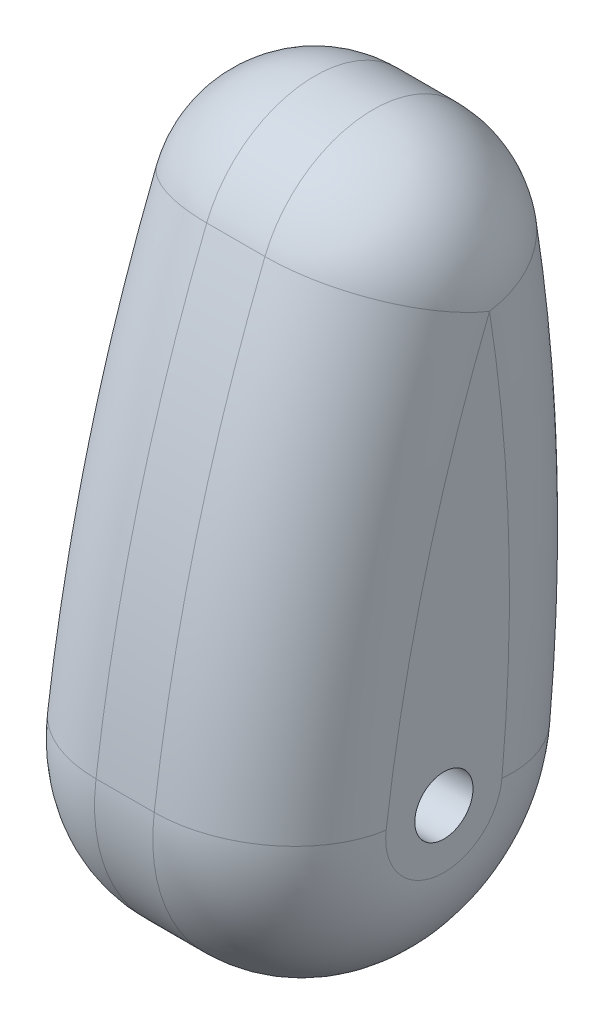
ISO-10303-21;
HEADER;
FILE_DESCRIPTION(('STEP AP214'),'2;1');
FILE_NAME('part.step','',(''),(''),'','','');
FILE_SCHEMA(('AUTOMOTIVE_DESIGN { 1 0 10303 214 1 1 1 1 }'));
ENDSEC;
DATA;
#1=APPLICATION_CONTEXT('core data for automotive mechanical design processes');
#2=APPLICATION_PROTOCOL_DEFINITION('international standard','automotive_design',2000,#1);
#3=PRODUCT_CONTEXT('',#1,'mechanical');
#4=PRODUCT('Part','Part','',(#3));
#5=PRODUCT_RELATED_PRODUCT_CATEGORY('part','',(#4));
#6=PRODUCT_DEFINITION_FORMATION('','',#4);
#7=PRODUCT_DEFINITION_CONTEXT('part definition',#1,'design');
#8=PRODUCT_DEFINITION('design','',#6,#7);
#9=PRODUCT_DEFINITION_SHAPE('','',#8);
#10=(LENGTH_UNIT() NAMED_UNIT(*) SI_UNIT(.MILLI.,.METRE.));
#11=(NAMED_UNIT(*) PLANE_ANGLE_UNIT() SI_UNIT($,.RADIAN.));
#12=(NAMED_UNIT(*) SI_UNIT($,.STERADIAN.) SOLID_ANGLE_UNIT());
#13=UNCERTAINTY_MEASURE_WITH_UNIT(LENGTH_MEASURE(1.E-05),#10,'distance_accuracy_value','');
#14=(GEOMETRIC_REPRESENTATION_CONTEXT(3) GLOBAL_UNCERTAINTY_ASSIGNED_CONTEXT((#13)) GLOBAL_UNIT_ASSIGNED_CONTEXT((#10,
#11,#12)) REPRESENTATION_CONTEXT('',''));
#15=CARTESIAN_POINT('',(0.,0.,0.));
#16=DIRECTION('',(0.,0.,1.));
#17=DIRECTION('',(1.,0.,0.));
#18=AXIS2_PLACEMENT_3D('',#15,#16,#17);
#19=CARTESIAN_POINT('',(63.5,105.260529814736,-686.134802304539));
#20=DIRECTION('',(-1.,0.,0.));
#21=DIRECTION('',(0.,0.,1.));
#22=AXIS2_PLACEMENT_3D('',#19,#20,#21);
#23=CYLINDRICAL_SURFACE('',#22,762.);
#24=DIRECTION('',(-1.,0.,0.));
#25=VECTOR('',#24,1.);
#26=CARTESIAN_POINT('',(63.5,388.31512238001,21.3424748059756));
#27=LINE('',#26,#25);
#28=CARTESIAN_POINT('',(12.7,388.31512238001,21.3424748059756));
#29=VERTEX_POINT('',#28);
#30=CARTESIAN_POINT('',(-12.7,388.31512238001,21.3424748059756));
#31=VERTEX_POINT('',#30);
#32=EDGE_CURVE('E136',#29,#31,#27,.T.);
#33=ORIENTED_EDGE('',*,*,#32,.T.);
#34=CARTESIAN_POINT('',(-12.7,105.260529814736,-686.134802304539));
#35=DIRECTION('',(-1.,0.,0.));
#36=DIRECTION('',(0.,0.,1.));
#37=AXIS2_PLACEMENT_3D('',#34,#35,#36);
#38=CIRCLE('',#37,762.);
#39=CARTESIAN_POINT('',(-12.7,202.482225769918,69.6376117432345));
#40=VERTEX_POINT('',#39);
#41=EDGE_CURVE('E155',#31,#40,#38,.F.);
#42=ORIENTED_EDGE('',*,*,#41,.T.);
#43=DIRECTION('',(-1.,0.,0.));
#44=VECTOR('',#43,1.);
#45=CARTESIAN_POINT('',(63.5,202.482225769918,69.6376117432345));
#46=LINE('',#45,#44);
#47=CARTESIAN_POINT('',(12.7,202.482225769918,69.6376117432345));
#48=VERTEX_POINT('',#47);
#49=EDGE_CURVE('E109',#48,#40,#46,.T.);
#50=ORIENTED_EDGE('',*,*,#49,.F.);
#51=CARTESIAN_POINT('',(12.7,105.260529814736,-686.134802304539));
#52=DIRECTION('',(-1.,0.,0.));
#53=DIRECTION('',(0.,0.,1.));
#54=AXIS2_PLACEMENT_3D('',#51,#52,#53);
#55=CIRCLE('',#54,762.);
#56=EDGE_CURVE('E153',#48,#29,#55,.T.);
#57=ORIENTED_EDGE('',*,*,#56,.T.);
#58=EDGE_LOOP('',(#33,#42,#50,#57));
#59=FACE_BOUND('',#58,.T.);
#60=ADVANCED_FACE('F31',(#59),#23,.T.);
#61=CARTESIAN_POINT('',(63.5,192.760056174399,-5.93962966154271));
#62=DIRECTION('',(-1.,0.,0.));
#63=DIRECTION('',(0.,0.,1.));
#64=AXIS2_PLACEMENT_3D('',#61,#62,#63);
#65=CYLINDRICAL_SURFACE('',#64,76.2);
#66=ORIENTED_EDGE('',*,*,#49,.T.);
#67=CARTESIAN_POINT('',(-12.7,192.760056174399,-5.93962966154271));
#68=DIRECTION('',(-1.,0.,0.));
#69=DIRECTION('',(0.,0.,1.));
#70=AXIS2_PLACEMENT_3D('',#67,#68,#69);
#71=CIRCLE('',#70,76.2);
#72=CARTESIAN_POINT('',(-12.7,185.441760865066,-81.7873887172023));
#73=VERTEX_POINT('',#72);
#74=EDGE_CURVE('E108',#40,#73,#71,.F.);
#75=ORIENTED_EDGE('',*,*,#74,.T.);
#76=DIRECTION('',(-1.,0.,0.));
#77=VECTOR('',#76,1.);
#78=CARTESIAN_POINT('',(63.5,185.441760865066,-81.7873887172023));
#79=LINE('',#78,#77);
#80=CARTESIAN_POINT('',(12.7,185.441760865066,-81.7873887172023));
#81=VERTEX_POINT('',#80);
#82=EDGE_CURVE('E90',#81,#73,#79,.T.);
#83=ORIENTED_EDGE('',*,*,#82,.F.);
#84=CARTESIAN_POINT('',(12.7,192.760056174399,-5.93962966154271));
#85=DIRECTION('',(-1.,0.,0.));
#86=DIRECTION('',(0.,0.,1.));
#87=AXIS2_PLACEMENT_3D('',#84,#85,#86);
#88=CIRCLE('',#87,76.2);
#89=EDGE_CURVE('E105',#81,#48,#88,.T.);
#90=ORIENTED_EDGE('',*,*,#89,.T.);
#91=EDGE_LOOP('',(#66,#75,#83,#90));
#92=FACE_BOUND('',#91,.T.);
#93=ADVANCED_FACE('F104',(#92),#65,.T.);
#94=CARTESIAN_POINT('',(63.5,258.624713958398,676.690201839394));
#95=DIRECTION('',(-1.,0.,0.));
#96=DIRECTION('',(0.,0.,1.));
#97=AXIS2_PLACEMENT_3D('',#94,#95,#96);
#98=CYLINDRICAL_SURFACE('',#97,762.);
#99=ORIENTED_EDGE('',*,*,#82,.T.);
#100=CARTESIAN_POINT('',(-12.7,258.624713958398,676.690201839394));
#101=DIRECTION('',(-1.,0.,0.));
#102=DIRECTION('',(0.,0.,1.));
#103=AXIS2_PLACEMENT_3D('',#100,#101,#102);
#104=CIRCLE('',#103,762.);
#105=CARTESIAN_POINT('',(-12.7,377.36053779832,-76.002168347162));
#106=VERTEX_POINT('',#105);
#107=EDGE_CURVE('E97',#73,#106,#104,.F.);
#108=ORIENTED_EDGE('',*,*,#107,.T.);
#109=DIRECTION('',(-1.,0.,0.));
#110=VECTOR('',#109,1.);
#111=CARTESIAN_POINT('',(63.5,377.36053779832,-76.002168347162));
#112=LINE('',#111,#110);
#113=CARTESIAN_POINT('',(12.7,377.36053779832,-76.002168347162));
#114=VERTEX_POINT('',#113);
#115=EDGE_CURVE('E92',#114,#106,#112,.T.);
#116=ORIENTED_EDGE('',*,*,#115,.F.);
#117=CARTESIAN_POINT('',(12.7,258.624713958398,676.690201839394));
#118=DIRECTION('',(-1.,0.,0.));
#119=DIRECTION('',(0.,0.,1.));
#120=AXIS2_PLACEMENT_3D('',#117,#118,#119);
#121=CIRCLE('',#120,762.);
#122=EDGE_CURVE('E87',#114,#81,#121,.T.);
#123=ORIENTED_EDGE('',*,*,#122,.T.);
#124=EDGE_LOOP('',(#99,#108,#116,#123));
#125=FACE_BOUND('',#124,.T.);
#126=ADVANCED_FACE('F89',(#125),#98,.T.);
#127=CARTESIAN_POINT('',(63.5,369.444816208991,-25.8226770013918));
#128=DIRECTION('',(-1.,0.,0.));
#129=DIRECTION('',(0.,0.,1.));
#130=AXIS2_PLACEMENT_3D('',#127,#128,#129);
#131=CYLINDRICAL_SURFACE('',#130,50.7999999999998);
#132=ORIENTED_EDGE('',*,*,#115,.T.);
#133=CARTESIAN_POINT('',(-12.7,369.444816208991,-25.8226770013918));
#134=DIRECTION('',(-1.,0.,0.));
#135=DIRECTION('',(0.,0.,1.));
#136=AXIS2_PLACEMENT_3D('',#133,#134,#135);
#137=CIRCLE('',#136,50.7999999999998);
#138=EDGE_CURVE('E151',#106,#31,#137,.F.);
#139=ORIENTED_EDGE('',*,*,#138,.T.);
#140=ORIENTED_EDGE('',*,*,#32,.F.);
#141=CARTESIAN_POINT('',(12.7,369.444816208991,-25.8226770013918));
#142=DIRECTION('',(-1.,0.,0.));
#143=DIRECTION('',(0.,0.,1.));
#144=AXIS2_PLACEMENT_3D('',#141,#142,#143);
#145=CIRCLE('',#144,50.7999999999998);
#146=EDGE_CURVE('E149',#29,#114,#145,.T.);
#147=ORIENTED_EDGE('',*,*,#146,.T.);
#148=EDGE_LOOP('',(#132,#139,#140,#147));
#149=FACE_BOUND('',#148,.T.);
#150=ADVANCED_FACE('F176',(#149),#131,.T.);
#151=CARTESIAN_POINT('',(63.5,237.352673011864,-355.978739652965));
#152=DIRECTION('',(-1.,0.,0.));
#153=DIRECTION('',(0.,0.,1.));
#154=AXIS2_PLACEMENT_3D('',#151,#152,#153);
#155=PLANE('',#154);
#156=CARTESIAN_POINT('',(63.5,192.760056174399,-5.93962966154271));
#157=DIRECTION('',(-1.,0.,0.));
#158=DIRECTION('',(0.,0.,1.));
#159=AXIS2_PLACEMENT_3D('',#156,#157,#158);
#160=CIRCLE('',#159,12.7);
#161=CARTESIAN_POINT('',(63.5,192.760056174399,6.76037033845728));
#162=VERTEX_POINT('',#161);
#163=EDGE_CURVE('E298',#162,#162,#160,.T.);
#164=ORIENTED_EDGE('',*,*,#163,.T.);
#165=EDGE_LOOP('',(#164));
#166=FACE_BOUND('',#165,.T.);
#167=CARTESIAN_POINT('',(63.5,192.760056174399,-5.93962966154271));
#168=DIRECTION('',(-1.,0.,0.));
#169=DIRECTION('',(0.,0.,1.));
#170=AXIS2_PLACEMENT_3D('',#167,#168,#169);
#171=CIRCLE('',#170,25.4);
#172=CARTESIAN_POINT('',(63.5,196.000779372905,19.2527841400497));
#173=VERTEX_POINT('',#172);
#174=CARTESIAN_POINT('',(63.5,190.320624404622,-31.2222160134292));
#175=VERTEX_POINT('',#174);
#176=EDGE_CURVE('E38',#173,#175,#171,.F.);
#177=ORIENTED_EDGE('',*,*,#176,.T.);
#178=CARTESIAN_POINT('',(63.5,258.624713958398,676.690201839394));
#179=DIRECTION('',(-1.,0.,0.));
#180=DIRECTION('',(0.,0.,1.));
#181=AXIS2_PLACEMENT_3D('',#178,#179,#180);
#182=CIRCLE('',#181,711.2);
#183=CARTESIAN_POINT('',(63.5,369.444816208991,-25.8226770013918));
#184=VERTEX_POINT('',#183);
#185=EDGE_CURVE('E11',#175,#184,#182,.F.);
#186=ORIENTED_EDGE('',*,*,#185,.T.);
#187=CARTESIAN_POINT('',(63.5,105.260529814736,-686.134802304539));
#188=DIRECTION('',(-1.,0.,0.));
#189=DIRECTION('',(0.,0.,1.));
#190=AXIS2_PLACEMENT_3D('',#187,#188,#189);
#191=CIRCLE('',#190,711.2);
#192=EDGE_CURVE('E47',#184,#173,#191,.F.);
#193=ORIENTED_EDGE('',*,*,#192,.T.);
#194=EDGE_LOOP('',(#177,#186,#193));
#195=FACE_BOUND('',#194,.T.);
#196=ADVANCED_FACE('F183',(#166,#195),#155,.F.);
#197=CARTESIAN_POINT('',(-63.5,237.352673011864,-355.978739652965));
#198=DIRECTION('',(-1.,0.,0.));
#199=DIRECTION('',(0.,0.,1.));
#200=AXIS2_PLACEMENT_3D('',#197,#198,#199);
#201=PLANE('',#200);
#202=CARTESIAN_POINT('',(-63.5,192.760056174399,-5.93962966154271));
#203=DIRECTION('',(-1.,0.,0.));
#204=DIRECTION('',(0.,0.,1.));
#205=AXIS2_PLACEMENT_3D('',#202,#203,#204);
#206=CIRCLE('',#205,12.7);
#207=CARTESIAN_POINT('',(-63.5,192.760056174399,6.76037033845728));
#208=VERTEX_POINT('',#207);
#209=EDGE_CURVE('E303',#208,#208,#206,.T.);
#210=ORIENTED_EDGE('',*,*,#209,.F.);
#211=EDGE_LOOP('',(#210));
#212=FACE_BOUND('',#211,.T.);
#213=CARTESIAN_POINT('',(-63.5,258.624713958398,676.690201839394));
#214=DIRECTION('',(-1.,0.,0.));
#215=DIRECTION('',(0.,0.,1.));
#216=AXIS2_PLACEMENT_3D('',#213,#214,#215);
#217=CIRCLE('',#216,711.2);
#218=CARTESIAN_POINT('',(-63.5,369.444816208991,-25.8226770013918));
#219=VERTEX_POINT('',#218);
#220=CARTESIAN_POINT('',(-63.5,190.320624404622,-31.2222160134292));
#221=VERTEX_POINT('',#220);
#222=EDGE_CURVE('E144',#219,#221,#217,.T.);
#223=ORIENTED_EDGE('',*,*,#222,.T.);
#224=CARTESIAN_POINT('',(-63.5,192.760056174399,-5.93962966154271));
#225=DIRECTION('',(-1.,0.,0.));
#226=DIRECTION('',(0.,0.,1.));
#227=AXIS2_PLACEMENT_3D('',#224,#225,#226);
#228=CIRCLE('',#227,25.4);
#229=CARTESIAN_POINT('',(-63.5,196.000779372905,19.2527841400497));
#230=VERTEX_POINT('',#229);
#231=EDGE_CURVE('E98',#221,#230,#228,.T.);
#232=ORIENTED_EDGE('',*,*,#231,.T.);
#233=CARTESIAN_POINT('',(-63.5,105.260529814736,-686.134802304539));
#234=DIRECTION('',(-1.,0.,0.));
#235=DIRECTION('',(0.,0.,1.));
#236=AXIS2_PLACEMENT_3D('',#233,#234,#235);
#237=CIRCLE('',#236,711.2);
#238=EDGE_CURVE('E142',#230,#219,#237,.T.);
#239=ORIENTED_EDGE('',*,*,#238,.T.);
#240=EDGE_LOOP('',(#223,#232,#239));
#241=FACE_BOUND('',#240,.T.);
#242=ADVANCED_FACE('F181',(#212,#241),#201,.T.);
#243=CARTESIAN_POINT('',(-12.7,369.444816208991,-25.8226770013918));
#244=DIRECTION('',(0.,0.,1.));
#245=DIRECTION('',(1.,0.,0.));
#246=AXIS2_PLACEMENT_3D('',#243,#244,#245);
#247=SPHERICAL_SURFACE('',#246,50.8);
#248=CARTESIAN_POINT('',(-12.7,369.444816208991,-25.8226770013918));
#249=DIRECTION('',(0.,-0.987785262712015,-0.155821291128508));
#250=DIRECTION('',(0.,0.155821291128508,-0.987785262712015));
#251=AXIS2_PLACEMENT_3D('',#248,#249,#250);
#252=CIRCLE('',#251,50.8);
#253=EDGE_CURVE('E130',#219,#106,#252,.T.);
#254=ORIENTED_EDGE('',*,*,#253,.F.);
#255=CARTESIAN_POINT('',(-12.7,369.444816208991,-25.822677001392));
#256=DIRECTION('',(0.,-0.928447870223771,0.371462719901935));
#257=DIRECTION('',(0.,-0.371462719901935,-0.928447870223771));
#258=AXIS2_PLACEMENT_3D('',#255,#256,#257);
#259=CIRCLE('',#258,50.8);
#260=EDGE_CURVE('E133',#31,#219,#259,.T.);
#261=ORIENTED_EDGE('',*,*,#260,.F.);
#262=ORIENTED_EDGE('',*,*,#138,.F.);
#263=EDGE_LOOP('',(#254,#261,#262));
#264=FACE_BOUND('',#263,.T.);
#265=ADVANCED_FACE('F179',(#264),#247,.T.);
#266=CARTESIAN_POINT('',(-12.7,105.260529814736,-686.134802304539));
#267=DIRECTION('',(-1.,0.,0.));
#268=DIRECTION('',(0.,0.,1.));
#269=AXIS2_PLACEMENT_3D('',#266,#267,#268);
#270=TOROIDAL_SURFACE('',#269,711.2,50.8);
#271=ORIENTED_EDGE('',*,*,#260,.T.);
#272=ORIENTED_EDGE('',*,*,#238,.F.);
#273=CARTESIAN_POINT('',(-12.7,196.000779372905,19.2527841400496));
#274=DIRECTION('',(0.,-0.991827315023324,0.127587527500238));
#275=DIRECTION('',(0.,-0.127587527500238,-0.991827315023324));
#276=AXIS2_PLACEMENT_3D('',#273,#274,#275);
#277=CIRCLE('',#276,50.8);
#278=EDGE_CURVE('E123',#40,#230,#277,.T.);
#279=ORIENTED_EDGE('',*,*,#278,.F.);
#280=ORIENTED_EDGE('',*,*,#41,.F.);
#281=EDGE_LOOP('',(#271,#272,#279,#280));
#282=FACE_BOUND('',#281,.T.);
#283=ADVANCED_FACE('F164',(#282),#270,.T.);
#284=CARTESIAN_POINT('',(-12.7,258.624713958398,676.690201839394));
#285=DIRECTION('',(-1.,0.,0.));
#286=DIRECTION('',(0.,0.,1.));
#287=AXIS2_PLACEMENT_3D('',#284,#285,#286);
#288=TOROIDAL_SURFACE('',#287,711.2,50.8);
#289=ORIENTED_EDGE('',*,*,#253,.T.);
#290=ORIENTED_EDGE('',*,*,#107,.F.);
#291=CARTESIAN_POINT('',(-12.7,190.320624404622,-31.2222160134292));
#292=DIRECTION('',(0.,-0.995377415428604,0.0960406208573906));
#293=DIRECTION('',(0.,-0.0960406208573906,-0.995377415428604));
#294=AXIS2_PLACEMENT_3D('',#291,#292,#293);
#295=CIRCLE('',#294,50.8);
#296=EDGE_CURVE('E121',#221,#73,#295,.T.);
#297=ORIENTED_EDGE('',*,*,#296,.F.);
#298=ORIENTED_EDGE('',*,*,#222,.F.);
#299=EDGE_LOOP('',(#289,#290,#297,#298));
#300=FACE_BOUND('',#299,.T.);
#301=ADVANCED_FACE('F172',(#300),#288,.T.);
#302=CARTESIAN_POINT('',(-12.7,192.760056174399,-5.93962966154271));
#303=DIRECTION('',(-1.,0.,0.));
#304=DIRECTION('',(0.,0.,1.));
#305=AXIS2_PLACEMENT_3D('',#302,#303,#304);
#306=DEGENERATE_TOROIDAL_SURFACE('',#305,25.4,50.8,.T.);
#307=ORIENTED_EDGE('',*,*,#278,.T.);
#308=ORIENTED_EDGE('',*,*,#231,.F.);
#309=ORIENTED_EDGE('',*,*,#296,.T.);
#310=ORIENTED_EDGE('',*,*,#74,.F.);
#311=EDGE_LOOP('',(#307,#308,#309,#310));
#312=FACE_BOUND('',#311,.T.);
#313=ADVANCED_FACE('F167',(#312),#306,.T.);
#314=CARTESIAN_POINT('',(12.7,192.760056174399,-5.93962966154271));
#315=DIRECTION('',(-1.,0.,0.));
#316=DIRECTION('',(0.,0.,1.));
#317=AXIS2_PLACEMENT_3D('',#314,#315,#316);
#318=DEGENERATE_TOROIDAL_SURFACE('',#317,25.4,50.8,.T.);
#319=CARTESIAN_POINT('',(12.7,196.000779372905,19.2527841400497));
#320=DIRECTION('',(0.,0.991827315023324,-0.127587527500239));
#321=DIRECTION('',(0.,0.127587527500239,0.991827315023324));
#322=AXIS2_PLACEMENT_3D('',#319,#320,#321);
#323=CIRCLE('',#322,50.8);
#324=EDGE_CURVE('E117',#48,#173,#323,.T.);
#325=ORIENTED_EDGE('',*,*,#324,.F.);
#326=ORIENTED_EDGE('',*,*,#89,.F.);
#327=CARTESIAN_POINT('',(12.7,190.320624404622,-31.2222160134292));
#328=DIRECTION('',(0.,0.995377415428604,-0.0960406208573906));
#329=DIRECTION('',(0.,0.0960406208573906,0.995377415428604));
#330=AXIS2_PLACEMENT_3D('',#327,#328,#329);
#331=CIRCLE('',#330,50.8);
#332=EDGE_CURVE('E114',#175,#81,#331,.T.);
#333=ORIENTED_EDGE('',*,*,#332,.F.);
#334=ORIENTED_EDGE('',*,*,#176,.F.);
#335=EDGE_LOOP('',(#325,#326,#333,#334));
#336=FACE_BOUND('',#335,.T.);
#337=ADVANCED_FACE('F113',(#336),#318,.T.);
#338=CARTESIAN_POINT('',(12.7,258.624713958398,676.690201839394));
#339=DIRECTION('',(-1.,0.,0.));
#340=DIRECTION('',(0.,0.,1.));
#341=AXIS2_PLACEMENT_3D('',#338,#339,#340);
#342=TOROIDAL_SURFACE('',#341,711.2,50.8);
#343=ORIENTED_EDGE('',*,*,#332,.T.);
#344=ORIENTED_EDGE('',*,*,#122,.F.);
#345=CARTESIAN_POINT('',(12.7,369.444816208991,-25.8226770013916));
#346=DIRECTION('',(0.,0.987785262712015,0.155821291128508));
#347=DIRECTION('',(0.,-0.155821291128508,0.987785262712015));
#348=AXIS2_PLACEMENT_3D('',#345,#346,#347);
#349=CIRCLE('',#348,50.8);
#350=EDGE_CURVE('E125',#184,#114,#349,.T.);
#351=ORIENTED_EDGE('',*,*,#350,.F.);
#352=ORIENTED_EDGE('',*,*,#185,.F.);
#353=EDGE_LOOP('',(#343,#344,#351,#352));
#354=FACE_BOUND('',#353,.T.);
#355=ADVANCED_FACE('F120',(#354),#342,.T.);
#356=CARTESIAN_POINT('',(12.7,105.260529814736,-686.134802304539));
#357=DIRECTION('',(-1.,0.,0.));
#358=DIRECTION('',(0.,0.,1.));
#359=AXIS2_PLACEMENT_3D('',#356,#357,#358);
#360=TOROIDAL_SURFACE('',#359,711.2,50.8);
#361=ORIENTED_EDGE('',*,*,#324,.T.);
#362=ORIENTED_EDGE('',*,*,#192,.F.);
#363=CARTESIAN_POINT('',(12.7,369.444816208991,-25.822677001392));
#364=DIRECTION('',(0.,0.928447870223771,-0.371462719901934));
#365=DIRECTION('',(0.,0.371462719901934,0.928447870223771));
#366=AXIS2_PLACEMENT_3D('',#363,#364,#365);
#367=CIRCLE('',#366,50.8);
#368=EDGE_CURVE('E297',#29,#184,#367,.T.);
#369=ORIENTED_EDGE('',*,*,#368,.F.);
#370=ORIENTED_EDGE('',*,*,#56,.F.);
#371=EDGE_LOOP('',(#361,#362,#369,#370));
#372=FACE_BOUND('',#371,.T.);
#373=ADVANCED_FACE('F240',(#372),#360,.T.);
#374=CARTESIAN_POINT('',(12.7,369.444816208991,-25.8226770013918));
#375=DIRECTION('',(0.,0.,1.));
#376=DIRECTION('',(1.,0.,0.));
#377=AXIS2_PLACEMENT_3D('',#374,#375,#376);
#378=SPHERICAL_SURFACE('',#377,50.8);
#379=ORIENTED_EDGE('',*,*,#350,.T.);
#380=ORIENTED_EDGE('',*,*,#146,.F.);
#381=ORIENTED_EDGE('',*,*,#368,.T.);
#382=EDGE_LOOP('',(#379,#380,#381));
#383=FACE_BOUND('',#382,.T.);
#384=ADVANCED_FACE('F219',(#383),#378,.T.);
#385=CARTESIAN_POINT('',(63.5,192.760056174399,-5.93962966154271));
#386=DIRECTION('',(-1.,0.,0.));
#387=DIRECTION('',(0.,0.,1.));
#388=AXIS2_PLACEMENT_3D('',#385,#386,#387);
#389=CYLINDRICAL_SURFACE('',#388,12.7);
#390=ORIENTED_EDGE('',*,*,#163,.F.);
#391=EDGE_LOOP('',(#390));
#392=FACE_BOUND('',#391,.T.);
#393=ORIENTED_EDGE('',*,*,#209,.T.);
#394=EDGE_LOOP('',(#393));
#395=FACE_BOUND('',#394,.T.);
#396=ADVANCED_FACE('F229',(#392,#395),#389,.F.);
#397=CLOSED_SHELL('',(#60,#93,#126,#150,#196,#242,#265,#283,#301,#313,#337,#355,#373,#384,#396));
#398=MANIFOLD_SOLID_BREP('B2',#397);
#399=ADVANCED_BREP_SHAPE_REPRESENTATION('',(#18,#398),#14);
#400=SHAPE_DEFINITION_REPRESENTATION(#9,#399);
ENDSEC;
END-ISO-10303-21;
